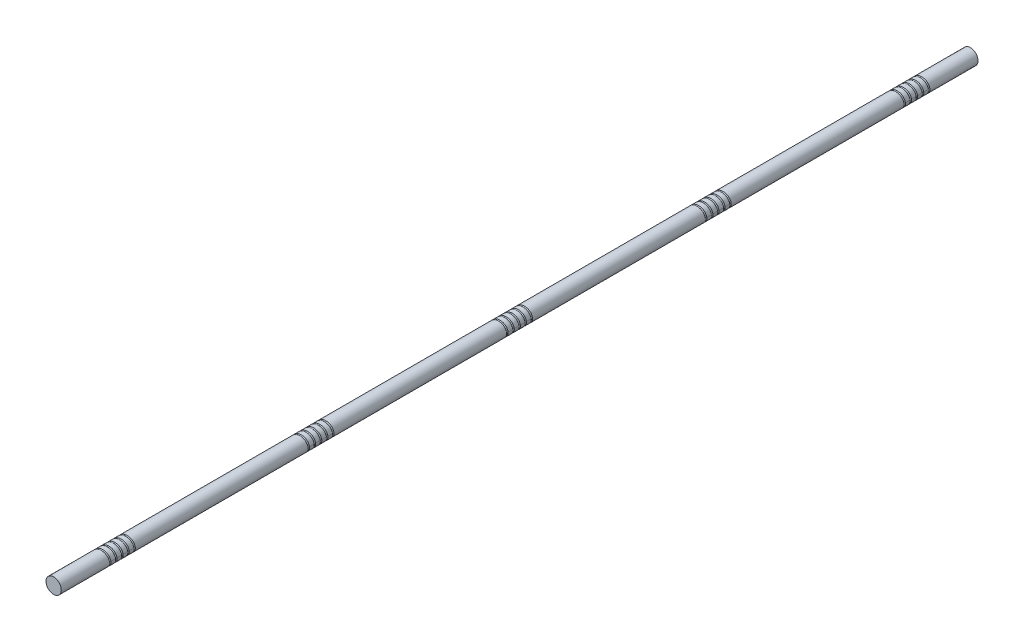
from build123d import *

# Parameters (mm, degrees)
SKETCH1_R              = 25
BOSS_EXTRUDE1_DEPTH    = 3000
CUT_SWEEP1_PITCH       = 20
CUT_SWEEP1_HEIGHT      = 100
CUT_SWEEP1_RADIUS      = 27.116666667
CUT_SWEEP1_START_ANGLE = -180
SKETCH3_R              = 3.175
LPATTERN1_COUNT        = 5
LPATTERN1_PITCH        = 650


with BuildPart() as part:
    # Sketch1 → Boss-Extrude1 (new body)
    with BuildSketch(Plane.XY):
        Circle(SKETCH1_R)
    extrude(amount=BOSS_EXTRUDE1_DEPTH)

    # Cut-Sweep1: sweep along a helix
    with BuildLine() as cut_sweep1_path:
        add(Helix(CUT_SWEEP1_PITCH, CUT_SWEEP1_HEIGHT, CUT_SWEEP1_RADIUS, center=(0, 0, 150), direction=(0, 0, 1), mode=Mode.PRIVATE).rotate(Axis((0, 0, 150), (0, 0, 1)), CUT_SWEEP1_START_ANGLE))
    # Sketch3 → Cut-Sweep1 (sweep, cut)
    with BuildSketch(Plane(origin=(0, 0, 0), x_dir=(1, 0, 0), z_dir=(0, 1, 0))):
        with Locations((-27.116666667, -150)):
            Circle(SKETCH3_R)
    cut_sweep1 = sweep(path=cut_sweep1_path.line, is_frenet=True, mode=Mode.SUBTRACT)

    # LPattern1: Cut-Sweep1 ×5
    with Locations(*[(0, 0, i * LPATTERN1_PITCH) for i in range(1, LPATTERN1_COUNT)]):
        add(cut_sweep1, mode=Mode.SUBTRACT)


solid = part.part
